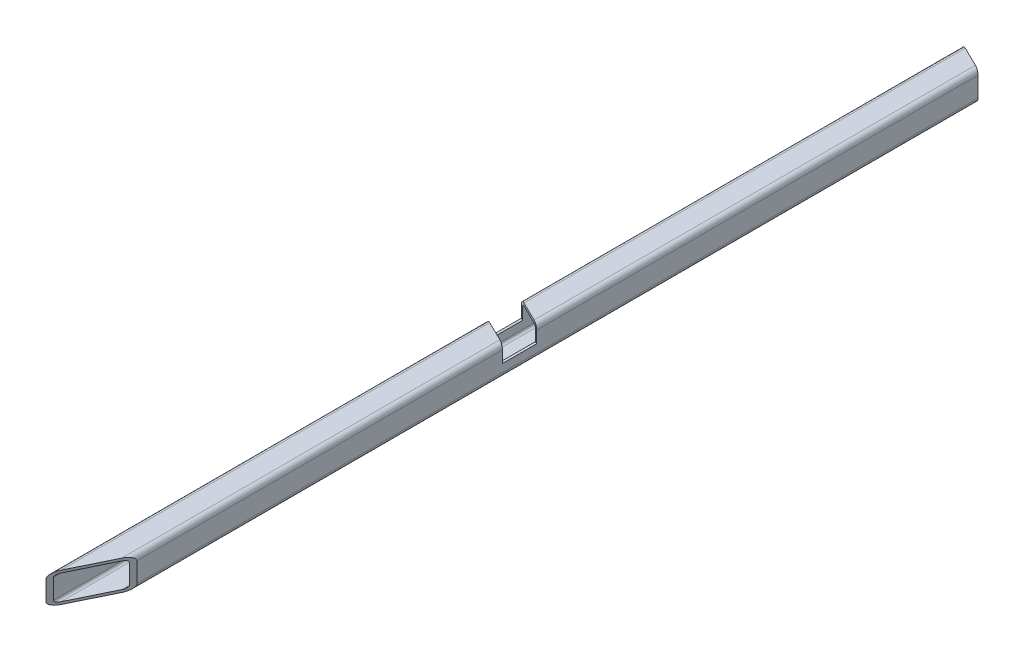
from build123d import *

# Parameters (mm, degrees)
EXTRUSION1_DEPTH = 1847.32
EXTRUSION2_DEPTH = 1849.537579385
EXTRUSION3_DEPTH = 1849.537579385
EXTRUSION4_DEPTH = 34


with BuildPart() as part:
    # Sketch1 → Extrusion1 (new body)
    with BuildSketch(Plane.XY):
        with BuildLine():
            Line((-20, -30), (20, -30))
            ThreePointArc((20, -30), (27.071067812, -27.071067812), (30, -20))
            Line((30, -20), (30, 20))
            ThreePointArc((30, 20), (27.071067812, 27.071067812), (20, 30))
            Line((20, 30), (-20, 30))
            ThreePointArc((-20, 30), (-27.071067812, 27.071067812), (-30, 20))
            Line((-30, 20), (-30, -20))
            ThreePointArc((-30, -20), (-27.071067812, -27.071067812), (-20, -30))
        make_face()
        with BuildLine():
            Line((-20, -25), (20, -25))
            ThreePointArc((20, -25), (23.535533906, -23.535533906), (25, -20))
            Line((25, -20), (25, 20))
            ThreePointArc((25, 20), (23.535533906, 23.535533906), (20, 25))
            Line((20, 25), (-20, 25))
            ThreePointArc((-20, 25), (-23.535533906, 23.535533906), (-25, 20))
            Line((-25, 20), (-25, -20))
            ThreePointArc((-25, -20), (-23.535533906, -23.535533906), (-20, -25))
        make_face(mode=Mode.SUBTRACT)
    extrude(amount=EXTRUSION1_DEPTH)

    # Esquisse1 → Extrusion2 (cut, through all)
    with BuildSketch(Plane(origin=(0, 30, 0), x_dir=(-1, 0, 0), z_dir=(0, 1, 0))):
        Polygon((-30, 1847.32), (30, 1847.32), (-30, 1724.301769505), align=None)
    extrude(amount=-EXTRUSION2_DEPTH, mode=Mode.SUBTRACT)

    # Esquisse2 → Extrusion3 (cut, through all)
    with BuildSketch(Plane(origin=(0, 30, 0), x_dir=(1, 0, 0), z_dir=(0, 1, 0))):
        Polygon((-30, 0), (30, 0), (30, -29.263955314), align=None)
    extrude(amount=-EXTRUSION3_DEPTH, mode=Mode.SUBTRACT)

    # Esquisse3 → Extrusion4 (cut)
    with BuildSketch(Plane(origin=(0, 30, 0), x_dir=(-1, 0, 0), z_dir=(0, 1, 0))):
        Polygon((120.150536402, 914.38169508), (-104.547975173, 1023.974481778), (-131.726986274, 968.249250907), (92.971525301, 858.65646421), align=None)
    extrude(amount=-EXTRUSION4_DEPTH, mode=Mode.SUBTRACT)


solid = part.part
